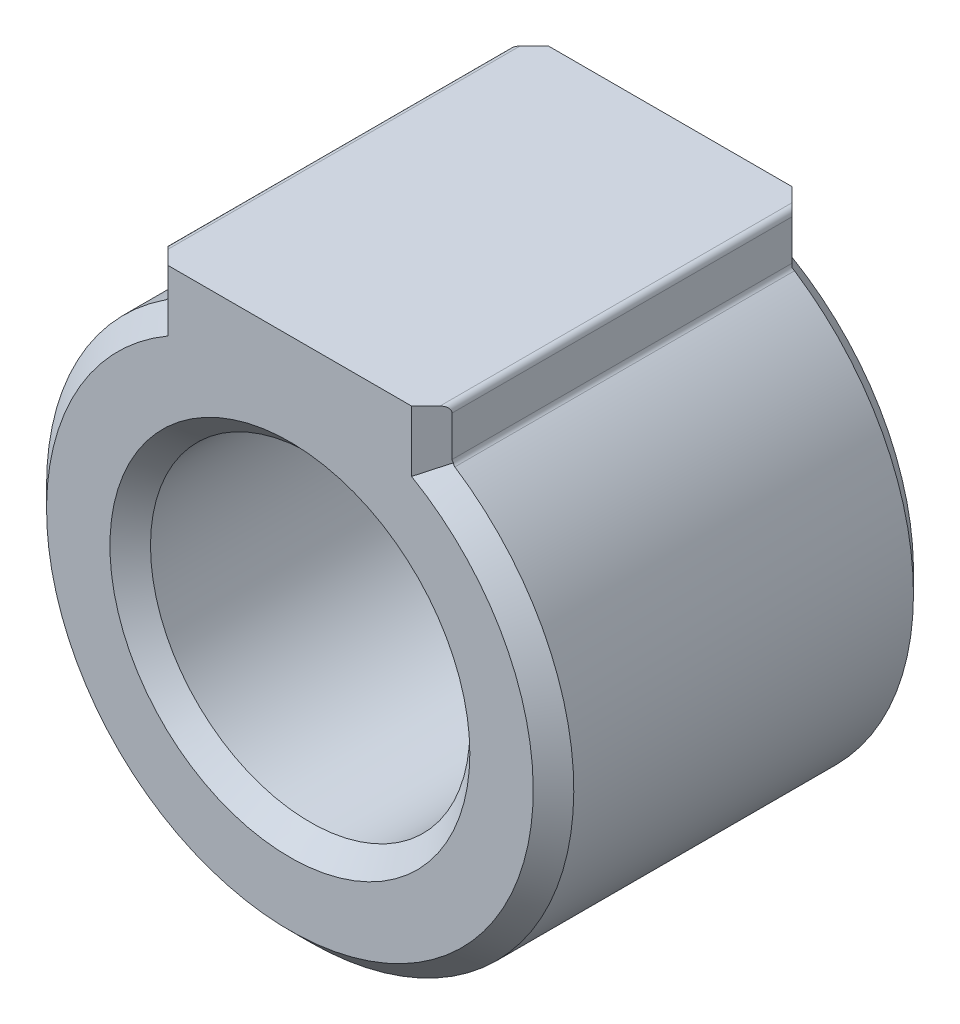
ISO-10303-21;
HEADER;
FILE_DESCRIPTION(('STEP AP214'),'2;1');
FILE_NAME('part.step','',(''),(''),'','','');
FILE_SCHEMA(('AUTOMOTIVE_DESIGN { 1 0 10303 214 1 1 1 1 }'));
ENDSEC;
DATA;
#1=APPLICATION_CONTEXT('core data for automotive mechanical design processes');
#2=APPLICATION_PROTOCOL_DEFINITION('international standard','automotive_design',2000,#1);
#3=PRODUCT_CONTEXT('',#1,'mechanical');
#4=PRODUCT('Part','Part','',(#3));
#5=PRODUCT_RELATED_PRODUCT_CATEGORY('part','',(#4));
#6=PRODUCT_DEFINITION_FORMATION('','',#4);
#7=PRODUCT_DEFINITION_CONTEXT('part definition',#1,'design');
#8=PRODUCT_DEFINITION('design','',#6,#7);
#9=PRODUCT_DEFINITION_SHAPE('','',#8);
#10=(LENGTH_UNIT() NAMED_UNIT(*) SI_UNIT(.MILLI.,.METRE.));
#11=(NAMED_UNIT(*) PLANE_ANGLE_UNIT() SI_UNIT($,.RADIAN.));
#12=(NAMED_UNIT(*) SI_UNIT($,.STERADIAN.) SOLID_ANGLE_UNIT());
#13=UNCERTAINTY_MEASURE_WITH_UNIT(LENGTH_MEASURE(1.E-05),#10,'distance_accuracy_value','');
#14=(GEOMETRIC_REPRESENTATION_CONTEXT(3) GLOBAL_UNCERTAINTY_ASSIGNED_CONTEXT((#13)) GLOBAL_UNIT_ASSIGNED_CONTEXT((#10,
#11,#12)) REPRESENTATION_CONTEXT('',''));
#15=CARTESIAN_POINT('',(0.,0.,0.));
#16=DIRECTION('',(0.,0.,1.));
#17=DIRECTION('',(1.,0.,0.));
#18=AXIS2_PLACEMENT_3D('',#15,#16,#17);
#19=CARTESIAN_POINT('',(0.,0.,0.));
#20=DIRECTION('',(0.,0.,1.));
#21=DIRECTION('',(1.,0.,0.));
#22=AXIS2_PLACEMENT_3D('',#19,#20,#21);
#23=CYLINDRICAL_SURFACE('',#22,2.);
#24=CARTESIAN_POINT('',(0.,0.,0.254000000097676));
#25=DIRECTION('',(0.,0.,-1.));
#26=DIRECTION('',(-1.,0.,0.));
#27=AXIS2_PLACEMENT_3D('',#24,#25,#26);
#28=CIRCLE('',#27,2.00000000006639);
#29=CARTESIAN_POINT('',(-2.00000000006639,0.,0.254000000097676));
#30=VERTEX_POINT('',#29);
#31=EDGE_CURVE('E284',#30,#30,#28,.T.);
#32=ORIENTED_EDGE('',*,*,#31,.T.);
#33=EDGE_LOOP('',(#32));
#34=FACE_BOUND('',#33,.T.);
#35=CARTESIAN_POINT('',(0.,0.,4.50849999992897));
#36=DIRECTION('',(0.,0.,1.));
#37=DIRECTION('',(-1.,0.,0.));
#38=AXIS2_PLACEMENT_3D('',#35,#36,#37);
#39=CIRCLE('',#38,2.00000000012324);
#40=CARTESIAN_POINT('',(-2.00000000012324,0.,4.50849999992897));
#41=VERTEX_POINT('',#40);
#42=EDGE_CURVE('E266',#41,#41,#39,.T.);
#43=ORIENTED_EDGE('',*,*,#42,.T.);
#44=EDGE_LOOP('',(#43));
#45=FACE_BOUND('',#44,.T.);
#46=ADVANCED_FACE('F16',(#34,#45),#23,.F.);
#47=CARTESIAN_POINT('',(-1.7018000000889,3.32740000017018,0.));
#48=DIRECTION('',(0.,0.,1.));
#49=DIRECTION('',(1.,0.,0.));
#50=AXIS2_PLACEMENT_3D('',#47,#48,#49);
#51=CYLINDRICAL_SURFACE('',#50,0.0762);
#52=CARTESIAN_POINT('',(-1.7018000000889,3.32740000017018,0.177800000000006));
#53=DIRECTION('',(-0.707106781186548,0.,-0.707106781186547));
#54=DIRECTION('',(-0.707106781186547,0.,0.707106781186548));
#55=AXIS2_PLACEMENT_3D('',#52,#53,#54);
#56=ELLIPSE('',#55,0.10776307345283,0.0762);
#57=CARTESIAN_POINT('',(-1.7018000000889,3.40360000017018,0.177800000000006));
#58=VERTEX_POINT('',#57);
#59=CARTESIAN_POINT('',(-1.7780000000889,3.32740000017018,0.254000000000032));
#60=VERTEX_POINT('',#59);
#61=EDGE_CURVE('E287',#58,#60,#56,.F.);
#62=ORIENTED_EDGE('',*,*,#61,.T.);
#63=DIRECTION('',(0.,0.,1.));
#64=VECTOR('',#63,1.);
#65=CARTESIAN_POINT('',(-1.7780000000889,3.32740000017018,0.));
#66=LINE('',#65,#64);
#67=CARTESIAN_POINT('',(-1.7780000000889,3.32740000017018,4.50849999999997));
#68=VERTEX_POINT('',#67);
#69=EDGE_CURVE('E263',#68,#60,#66,.F.);
#70=ORIENTED_EDGE('',*,*,#69,.F.);
#71=CARTESIAN_POINT('',(-1.7018000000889,3.32740000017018,4.5847));
#72=DIRECTION('',(-0.707106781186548,0.,0.707106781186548));
#73=DIRECTION('',(0.707106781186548,0.,0.707106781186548));
#74=AXIS2_PLACEMENT_3D('',#71,#72,#73);
#75=ELLIPSE('',#74,0.10776307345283,0.0762);
#76=CARTESIAN_POINT('',(-1.7018000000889,3.40360000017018,4.5847));
#77=VERTEX_POINT('',#76);
#78=EDGE_CURVE('E19',#68,#77,#75,.F.);
#79=ORIENTED_EDGE('',*,*,#78,.T.);
#80=DIRECTION('',(0.,0.,1.));
#81=VECTOR('',#80,1.);
#82=CARTESIAN_POINT('',(-1.7018000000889,3.40360000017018,0.));
#83=LINE('',#82,#81);
#84=EDGE_CURVE('E274',#58,#77,#83,.T.);
#85=ORIENTED_EDGE('',*,*,#84,.F.);
#86=EDGE_LOOP('',(#62,#70,#79,#85));
#87=FACE_BOUND('',#86,.T.);
#88=ADVANCED_FACE('F332',(#87),#51,.T.);
#89=CARTESIAN_POINT('',(0.,0.,-1.70530256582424E-10));
#90=DIRECTION('',(0.,0.,-1.));
#91=DIRECTION('',(-1.,0.,0.));
#92=AXIS2_PLACEMENT_3D('',#89,#90,#91);
#93=CONICAL_SURFACE('',#92,2.2539999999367,0.785398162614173);
#94=CARTESIAN_POINT('',(0.,0.,-1.13686837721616E-10));
#95=DIRECTION('',(0.,0.,-1.));
#96=DIRECTION('',(-1.,0.,0.));
#97=AXIS2_PLACEMENT_3D('',#94,#95,#96);
#98=CIRCLE('',#97,2.25399999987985);
#99=CARTESIAN_POINT('',(-2.25399999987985,0.,-1.13686837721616E-10));
#100=VERTEX_POINT('',#99);
#101=EDGE_CURVE('E279',#100,#100,#98,.T.);
#102=ORIENTED_EDGE('',*,*,#101,.T.);
#103=EDGE_LOOP('',(#102));
#104=FACE_BOUND('',#103,.T.);
#105=ORIENTED_EDGE('',*,*,#31,.F.);
#106=EDGE_LOOP('',(#105));
#107=FACE_BOUND('',#106,.T.);
#108=ADVANCED_FACE('F436',(#104,#107),#93,.F.);
#109=CARTESIAN_POINT('',(1.7018000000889,3.32740000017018,0.));
#110=DIRECTION('',(0.,0.,1.));
#111=DIRECTION('',(1.,0.,0.));
#112=AXIS2_PLACEMENT_3D('',#109,#110,#111);
#113=CYLINDRICAL_SURFACE('',#112,0.0762);
#114=CARTESIAN_POINT('',(1.7018000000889,3.32740000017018,0.177800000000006));
#115=DIRECTION('',(0.707106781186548,0.,-0.707106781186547));
#116=DIRECTION('',(0.707106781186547,0.,0.707106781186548));
#117=AXIS2_PLACEMENT_3D('',#114,#115,#116);
#118=ELLIPSE('',#117,0.10776307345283,0.0762);
#119=CARTESIAN_POINT('',(1.7780000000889,3.32740000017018,0.253999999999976));
#120=VERTEX_POINT('',#119);
#121=CARTESIAN_POINT('',(1.7018000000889,3.40360000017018,0.177800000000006));
#122=VERTEX_POINT('',#121);
#123=EDGE_CURVE('E283',#120,#122,#118,.F.);
#124=ORIENTED_EDGE('',*,*,#123,.T.);
#125=DIRECTION('',(0.,0.,1.));
#126=VECTOR('',#125,1.);
#127=CARTESIAN_POINT('',(1.7018000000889,3.40360000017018,0.));
#128=LINE('',#127,#126);
#129=CARTESIAN_POINT('',(1.7018000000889,3.40360000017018,4.5847));
#130=VERTEX_POINT('',#129);
#131=EDGE_CURVE('E147',#130,#122,#128,.F.);
#132=ORIENTED_EDGE('',*,*,#131,.F.);
#133=CARTESIAN_POINT('',(1.7018000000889,3.32740000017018,4.5847));
#134=DIRECTION('',(0.707106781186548,0.,0.707106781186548));
#135=DIRECTION('',(-0.707106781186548,0.,0.707106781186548));
#136=AXIS2_PLACEMENT_3D('',#133,#134,#135);
#137=ELLIPSE('',#136,0.10776307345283,0.0762);
#138=CARTESIAN_POINT('',(1.7780000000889,3.32740000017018,4.50849999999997));
#139=VERTEX_POINT('',#138);
#140=EDGE_CURVE('E143',#130,#139,#137,.F.);
#141=ORIENTED_EDGE('',*,*,#140,.T.);
#142=DIRECTION('',(0.,0.,-1.));
#143=VECTOR('',#142,1.);
#144=CARTESIAN_POINT('',(1.7780000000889,3.32740000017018,0.));
#145=LINE('',#144,#143);
#146=EDGE_CURVE('E251',#120,#139,#145,.F.);
#147=ORIENTED_EDGE('',*,*,#146,.F.);
#148=EDGE_LOOP('',(#124,#132,#141,#147));
#149=FACE_BOUND('',#148,.T.);
#150=ADVANCED_FACE('F361',(#149),#113,.T.);
#151=CARTESIAN_POINT('',(-1.7780000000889,3.40360000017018,0.));
#152=DIRECTION('',(0.,1.,0.));
#153=DIRECTION('',(0.,0.,1.));
#154=AXIS2_PLACEMENT_3D('',#151,#152,#153);
#155=PLANE('',#154);
#156=DIRECTION('',(1.,0.,0.));
#157=VECTOR('',#156,1.);
#158=CARTESIAN_POINT('',(0.,3.40360000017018,0.));
#159=LINE('',#158,#157);
#160=CARTESIAN_POINT('',(1.5240000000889,3.40360000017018,0.));
#161=VERTEX_POINT('',#160);
#162=CARTESIAN_POINT('',(-1.5240000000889,3.40360000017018,0.));
#163=VERTEX_POINT('',#162);
#164=EDGE_CURVE('E126',#161,#163,#159,.F.);
#165=ORIENTED_EDGE('',*,*,#164,.T.);
#166=DIRECTION('',(-0.707106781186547,0.,0.707106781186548));
#167=VECTOR('',#166,1.);
#168=CARTESIAN_POINT('',(-1.6510000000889,3.40360000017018,0.126999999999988));
#169=LINE('',#168,#167);
#170=EDGE_CURVE('E328',#58,#163,#169,.F.);
#171=ORIENTED_EDGE('',*,*,#170,.F.);
#172=ORIENTED_EDGE('',*,*,#84,.T.);
#173=DIRECTION('',(0.707106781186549,0.,0.707106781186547));
#174=VECTOR('',#173,1.);
#175=CARTESIAN_POINT('',(-1.7018000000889,3.40360000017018,4.5847));
#176=LINE('',#175,#174);
#177=CARTESIAN_POINT('',(-1.5240000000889,3.40360000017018,4.7625));
#178=VERTEX_POINT('',#177);
#179=EDGE_CURVE('E148',#77,#178,#176,.T.);
#180=ORIENTED_EDGE('',*,*,#179,.T.);
#181=DIRECTION('',(1.,0.,0.));
#182=VECTOR('',#181,1.);
#183=CARTESIAN_POINT('',(0.,3.40360000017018,4.7625));
#184=LINE('',#183,#182);
#185=CARTESIAN_POINT('',(1.5240000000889,3.40360000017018,4.7625));
#186=VERTEX_POINT('',#185);
#187=EDGE_CURVE('E151',#186,#178,#184,.F.);
#188=ORIENTED_EDGE('',*,*,#187,.F.);
#189=DIRECTION('',(0.70710678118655,0.,-0.707106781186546));
#190=VECTOR('',#189,1.);
#191=CARTESIAN_POINT('',(1.5240000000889,3.40360000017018,4.7625));
#192=LINE('',#191,#190);
#193=EDGE_CURVE('E134',#186,#130,#192,.T.);
#194=ORIENTED_EDGE('',*,*,#193,.T.);
#195=ORIENTED_EDGE('',*,*,#131,.T.);
#196=DIRECTION('',(-0.707106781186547,0.,-0.707106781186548));
#197=VECTOR('',#196,1.);
#198=CARTESIAN_POINT('',(1.6510000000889,3.40360000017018,0.126999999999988));
#199=LINE('',#198,#197);
#200=EDGE_CURVE('E158',#161,#122,#199,.F.);
#201=ORIENTED_EDGE('',*,*,#200,.F.);
#202=EDGE_LOOP('',(#165,#171,#172,#180,#188,#194,#195,#201));
#203=FACE_BOUND('',#202,.T.);
#204=ADVANCED_FACE('F152',(#203),#155,.T.);
#205=CARTESIAN_POINT('',(0.,0.,4.76250000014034));
#206=DIRECTION('',(0.,0.,1.));
#207=DIRECTION('',(1.,0.,0.));
#208=AXIS2_PLACEMENT_3D('',#205,#206,#207);
#209=CONICAL_SURFACE('',#208,2.25399999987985,0.785398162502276);
#210=CARTESIAN_POINT('',(0.,0.,4.76250000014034));
#211=DIRECTION('',(0.,0.,1.));
#212=DIRECTION('',(1.,0.,0.));
#213=AXIS2_PLACEMENT_3D('',#210,#211,#212);
#214=CIRCLE('',#213,2.25399999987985);
#215=CARTESIAN_POINT('',(2.25399999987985,0.,4.76250000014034));
#216=VERTEX_POINT('',#215);
#217=EDGE_CURVE('E157',#216,#216,#214,.F.);
#218=ORIENTED_EDGE('',*,*,#217,.F.);
#219=EDGE_LOOP('',(#218));
#220=FACE_BOUND('',#219,.T.);
#221=ORIENTED_EDGE('',*,*,#42,.F.);
#222=EDGE_LOOP('',(#221));
#223=FACE_BOUND('',#222,.T.);
#224=ADVANCED_FACE('F424',(#220,#223),#209,.F.);
#225=CARTESIAN_POINT('',(-1.7780000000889,2.78243059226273,0.));
#226=DIRECTION('',(-1.,0.,0.));
#227=DIRECTION('',(0.,0.,1.));
#228=AXIS2_PLACEMENT_3D('',#225,#226,#227);
#229=PLANE('',#228);
#230=DIRECTION('',(0.,0.,1.));
#231=VECTOR('',#230,1.);
#232=CARTESIAN_POINT('',(-1.7780000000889,2.82385863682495,0.));
#233=LINE('',#232,#231);
#234=CARTESIAN_POINT('',(-1.7780000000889,2.82385863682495,0.254000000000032));
#235=VERTEX_POINT('',#234);
#236=CARTESIAN_POINT('',(-1.7780000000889,2.82385863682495,4.50849999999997));
#237=VERTEX_POINT('',#236);
#238=EDGE_CURVE('E321',#235,#237,#233,.T.);
#239=ORIENTED_EDGE('',*,*,#238,.T.);
#240=DIRECTION('',(0.,1.,0.));
#241=VECTOR('',#240,1.);
#242=CARTESIAN_POINT('',(-1.7780000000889,1.61622361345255,4.50850000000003));
#243=LINE('',#242,#241);
#244=EDGE_CURVE('E167',#68,#237,#243,.F.);
#245=ORIENTED_EDGE('',*,*,#244,.F.);
#246=ORIENTED_EDGE('',*,*,#69,.T.);
#247=DIRECTION('',(0.,1.,0.));
#248=VECTOR('',#247,1.);
#249=CARTESIAN_POINT('',(-1.7780000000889,1.61622361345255,0.253999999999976));
#250=LINE('',#249,#248);
#251=EDGE_CURVE('E259',#235,#60,#250,.T.);
#252=ORIENTED_EDGE('',*,*,#251,.F.);
#253=EDGE_LOOP('',(#239,#245,#246,#252));
#254=FACE_BOUND('',#253,.T.);
#255=ADVANCED_FACE('F416',(#254),#229,.T.);
#256=CARTESIAN_POINT('',(0.,0.450016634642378,0.));
#257=DIRECTION('',(0.,0.,1.));
#258=DIRECTION('',(1.,0.,0.));
#259=AXIS2_PLACEMENT_3D('',#256,#257,#258);
#260=PLANE('',#259);
#261=ORIENTED_EDGE('',*,*,#101,.F.);
#262=EDGE_LOOP('',(#261));
#263=FACE_BOUND('',#262,.T.);
#264=ORIENTED_EDGE('',*,*,#164,.F.);
#265=DIRECTION('',(0.,1.,0.));
#266=VECTOR('',#265,1.);
#267=CARTESIAN_POINT('',(1.5240000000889,1.92680831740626,0.));
#268=LINE('',#267,#266);
#269=CARTESIAN_POINT('',(1.52400000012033,2.63964543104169,-3.71924713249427E-11));
#270=VERTEX_POINT('',#269);
#271=EDGE_CURVE('E349',#270,#161,#268,.T.);
#272=ORIENTED_EDGE('',*,*,#271,.F.);
#273=CARTESIAN_POINT('',(0.,0.,-5.6843418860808E-11));
#274=DIRECTION('',(0.,0.,1.));
#275=DIRECTION('',(1.,0.,0.));
#276=AXIS2_PLACEMENT_3D('',#273,#274,#275);
#277=CIRCLE('',#276,3.04800000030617);
#278=CARTESIAN_POINT('',(-1.52400000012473,2.63964543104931,-2.8421709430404E-11));
#279=VERTEX_POINT('',#278);
#280=EDGE_CURVE('E250',#279,#270,#277,.T.);
#281=ORIENTED_EDGE('',*,*,#280,.F.);
#282=DIRECTION('',(0.,1.,0.));
#283=VECTOR('',#282,1.);
#284=CARTESIAN_POINT('',(-1.5240000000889,1.61622361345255,0.));
#285=LINE('',#284,#283);
#286=EDGE_CURVE('E340',#163,#279,#285,.F.);
#287=ORIENTED_EDGE('',*,*,#286,.F.);
#288=EDGE_LOOP('',(#264,#272,#281,#287));
#289=FACE_BOUND('',#288,.T.);
#290=ADVANCED_FACE('F414',(#263,#289),#260,.F.);
#291=CARTESIAN_POINT('',(-1.6510000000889,1.61622361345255,0.126999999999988));
#292=DIRECTION('',(-0.707106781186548,0.,-0.707106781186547));
#293=DIRECTION('',(-0.707106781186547,0.,0.707106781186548));
#294=AXIS2_PLACEMENT_3D('',#291,#292,#293);
#295=PLANE('',#294);
#296=CARTESIAN_POINT('',(-1.8542000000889,2.82385863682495,0.330200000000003));
#297=DIRECTION('',(-0.707106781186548,0.,-0.707106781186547));
#298=DIRECTION('',(-0.707106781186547,0.,0.707106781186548));
#299=AXIS2_PLACEMENT_3D('',#296,#297,#298);
#300=ELLIPSE('',#299,0.10776307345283,0.0762);
#301=CARTESIAN_POINT('',(-1.78724056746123,2.78748725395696,0.263240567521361));
#302=VERTEX_POINT('',#301);
#303=EDGE_CURVE('E165',#302,#235,#300,.F.);
#304=ORIENTED_EDGE('',*,*,#303,.T.);
#305=ORIENTED_EDGE('',*,*,#251,.T.);
#306=ORIENTED_EDGE('',*,*,#61,.F.);
#307=ORIENTED_EDGE('',*,*,#170,.T.);
#308=ORIENTED_EDGE('',*,*,#286,.T.);
#309=CARTESIAN_POINT('',(-1.77800000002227,2.78243059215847,0.254000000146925));
#310=CARTESIAN_POINT('',(-1.76706834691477,2.7764432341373,0.243068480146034));
#311=CARTESIAN_POINT('',(-1.75614127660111,2.77043909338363,0.232141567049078));
#312=CARTESIAN_POINT('',(-1.73438536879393,2.75844561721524,0.210385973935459));
#313=CARTESIAN_POINT('',(-1.72355645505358,2.75245655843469,0.199557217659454));
#314=CARTESIAN_POINT('',(-1.70199690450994,2.74049351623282,0.177997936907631));
#315=CARTESIAN_POINT('',(-1.69126619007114,2.73451981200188,0.167267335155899));
#316=CARTESIAN_POINT('',(-1.6699030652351,2.72258776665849,0.145904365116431));
#317=CARTESIAN_POINT('',(-1.65927057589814,2.71662970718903,0.135271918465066));
#318=CARTESIAN_POINT('',(-1.63810391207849,2.70472925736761,0.11410525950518));
#319=CARTESIAN_POINT('',(-1.62756965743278,2.6987871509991,0.103570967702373));
#320=CARTESIAN_POINT('',(-1.60659945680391,2.68691893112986,0.0826006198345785));
#321=CARTESIAN_POINT('',(-1.59616342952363,2.68099310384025,0.0721644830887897));
#322=CARTESIAN_POINT('',(-1.57538966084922,2.66915778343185,0.0513904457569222));
#323=CARTESIAN_POINT('',(-1.56505183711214,2.66324857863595,0.0410524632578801));
#324=CARTESIAN_POINT('',(-1.54447443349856,2.65144686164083,0.0204747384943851));
#325=CARTESIAN_POINT('',(-1.5342347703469,2.64555463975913,0.0102349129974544));
#326=CARTESIAN_POINT('',(-1.52400000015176,2.63964543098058,-7.44335149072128E-11));
#327=B_SPLINE_CURVE_WITH_KNOTS('',3,(#309,#310,#311,#312,#313,#314,#315,#316,#317,#318,#319,
#320,#321,#322,#323,#324,#325,#326),.UNSPECIFIED.,.F.,.F.,(4,2,2,2,2,2,2,2,4),(0.,
0.0497355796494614,0.0990667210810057,0.147993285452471,0.196515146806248,0.244632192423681,
0.292344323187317,0.339651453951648,0.386553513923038),.UNSPECIFIED.);
#328=CARTESIAN_POINT('',(-1.77800000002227,2.78243059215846,0.254000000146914));
#329=VERTEX_POINT('',#328);
#330=EDGE_CURVE('E229',#329,#279,#327,.T.);
#331=ORIENTED_EDGE('',*,*,#330,.F.);
#332=CARTESIAN_POINT('',(-1.78724058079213,2.78748727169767,0.26324058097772));
#333=CARTESIAN_POINT('',(-1.78685515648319,2.78727703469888,0.262855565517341));
#334=CARTESIAN_POINT('',(-1.78646977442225,2.78706673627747,0.262470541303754));
#335=CARTESIAN_POINT('',(-1.78569911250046,2.786646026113,0.261700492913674));
#336=CARTESIAN_POINT('',(-1.78531383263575,2.78643561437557,0.261315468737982));
#337=CARTESIAN_POINT('',(-1.78454337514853,2.78601467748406,0.260545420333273));
#338=CARTESIAN_POINT('',(-1.78415819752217,2.78580415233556,0.260160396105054));
#339=CARTESIAN_POINT('',(-1.78338794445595,2.78538298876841,0.259390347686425));
#340=CARTESIAN_POINT('',(-1.78300286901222,2.78517235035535,0.25900532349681));
#341=CARTESIAN_POINT('',(-1.78223282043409,2.78475096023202,0.258235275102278));
#342=CARTESIAN_POINT('',(-1.78184784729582,2.78454020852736,0.257850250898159));
#343=CARTESIAN_POINT('',(-1.7810780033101,2.78411859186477,0.257080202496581));
#344=CARTESIAN_POINT('',(-1.7806931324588,2.78390772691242,0.256695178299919));
#345=CARTESIAN_POINT('',(-1.77992349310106,2.78348588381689,0.255925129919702));
#346=CARTESIAN_POINT('',(-1.77953872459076,2.7832749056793,0.255540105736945));
#347=CARTESIAN_POINT('',(-1.77876928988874,2.78285283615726,0.254770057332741));
#348=CARTESIAN_POINT('',(-1.77838462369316,2.78264174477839,0.254385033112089));
#349=CARTESIAN_POINT('',(-1.77799999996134,2.78243059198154,0.254000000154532));
#350=B_SPLINE_CURVE_WITH_KNOTS('',3,(#332,#333,#334,#335,#336,#337,#338,#339,#340,#341,#342,
#343,#344,#345,#346,#347,#348,#349),.UNSPECIFIED.,.F.,.F.,(4,2,2,2,2,2,2,2,4),(0.,
0.00175182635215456,0.00350357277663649,0.00525523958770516,0.00700682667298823,
0.00875833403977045,0.010509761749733,0.012261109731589,0.0140123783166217),.UNSPECIFIED.);
#351=EDGE_CURVE('E224',#302,#329,#350,.T.);
#352=ORIENTED_EDGE('',*,*,#351,.F.);
#353=EDGE_LOOP('',(#304,#305,#306,#307,#308,#331,#352));
#354=FACE_BOUND('',#353,.T.);
#355=ADVANCED_FACE('F413',(#354),#295,.T.);
#356=CARTESIAN_POINT('',(1.7780000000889,3.40360000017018,0.));
#357=DIRECTION('',(1.,0.,0.));
#358=DIRECTION('',(0.,0.,-1.));
#359=AXIS2_PLACEMENT_3D('',#356,#357,#358);
#360=PLANE('',#359);
#361=DIRECTION('',(0.,0.,1.));
#362=VECTOR('',#361,1.);
#363=CARTESIAN_POINT('',(1.7780000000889,2.82385863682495,0.));
#364=LINE('',#363,#362);
#365=CARTESIAN_POINT('',(1.7780000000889,2.82385863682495,4.50850000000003));
#366=VERTEX_POINT('',#365);
#367=CARTESIAN_POINT('',(1.7780000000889,2.82385863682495,0.253999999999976));
#368=VERTEX_POINT('',#367);
#369=EDGE_CURVE('E197',#366,#368,#364,.F.);
#370=ORIENTED_EDGE('',*,*,#369,.T.);
#371=DIRECTION('',(0.,1.,0.));
#372=VECTOR('',#371,1.);
#373=CARTESIAN_POINT('',(1.7780000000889,1.92680831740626,0.253999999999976));
#374=LINE('',#373,#372);
#375=EDGE_CURVE('E258',#120,#368,#374,.F.);
#376=ORIENTED_EDGE('',*,*,#375,.F.);
#377=ORIENTED_EDGE('',*,*,#146,.T.);
#378=DIRECTION('',(0.,1.,0.));
#379=VECTOR('',#378,1.);
#380=CARTESIAN_POINT('',(1.7780000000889,1.92680831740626,4.50850000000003));
#381=LINE('',#380,#379);
#382=EDGE_CURVE('E162',#366,#139,#381,.T.);
#383=ORIENTED_EDGE('',*,*,#382,.F.);
#384=EDGE_LOOP('',(#370,#376,#377,#383));
#385=FACE_BOUND('',#384,.T.);
#386=ADVANCED_FACE('F364',(#385),#360,.T.);
#387=CARTESIAN_POINT('',(1.6510000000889,1.92680831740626,0.126999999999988));
#388=DIRECTION('',(0.707106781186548,0.,-0.707106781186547));
#389=DIRECTION('',(-0.707106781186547,0.,-0.707106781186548));
#390=AXIS2_PLACEMENT_3D('',#387,#388,#389);
#391=PLANE('',#390);
#392=ORIENTED_EDGE('',*,*,#271,.T.);
#393=ORIENTED_EDGE('',*,*,#200,.T.);
#394=ORIENTED_EDGE('',*,*,#123,.F.);
#395=ORIENTED_EDGE('',*,*,#375,.T.);
#396=CARTESIAN_POINT('',(1.8542000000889,2.82385863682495,0.330200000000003));
#397=DIRECTION('',(0.707106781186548,0.,-0.707106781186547));
#398=DIRECTION('',(0.707106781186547,0.,0.707106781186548));
#399=AXIS2_PLACEMENT_3D('',#396,#397,#398);
#400=ELLIPSE('',#399,0.10776307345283,0.0762);
#401=CARTESIAN_POINT('',(1.78724043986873,2.78748720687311,0.26324044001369));
#402=VERTEX_POINT('',#401);
#403=EDGE_CURVE('E199',#368,#402,#400,.F.);
#404=ORIENTED_EDGE('',*,*,#403,.T.);
#405=CARTESIAN_POINT('',(1.77799999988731,2.78243059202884,0.254000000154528));
#406=CARTESIAN_POINT('',(1.77838462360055,2.78264174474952,0.254385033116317));
#407=CARTESIAN_POINT('',(1.77876928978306,2.78285283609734,0.254770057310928));
#408=CARTESIAN_POINT('',(1.77953872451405,2.78327490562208,0.255540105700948));
#409=CARTESIAN_POINT('',(1.7799234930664,2.78348588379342,0.255925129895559));
#410=CARTESIAN_POINT('',(1.78069313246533,2.78390772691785,0.256695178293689));
#411=CARTESIAN_POINT('',(1.78107800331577,2.78411859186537,0.257080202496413));
#412=CARTESIAN_POINT('',(1.78184784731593,2.78454020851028,0.25785025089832));
#413=CARTESIAN_POINT('',(1.78223282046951,2.78475096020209,0.258235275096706));
#414=CARTESIAN_POINT('',(1.78300286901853,2.78517235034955,0.259005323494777));
#415=CARTESIAN_POINT('',(1.78338794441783,2.78538298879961,0.259390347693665));
#416=CARTESIAN_POINT('',(1.78415819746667,2.7858041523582,0.260160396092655));
#417=CARTESIAN_POINT('',(1.78454337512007,2.78601467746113,0.26054542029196));
#418=CARTESIAN_POINT('',(1.78531383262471,2.78643561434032,0.261315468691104));
#419=CARTESIAN_POINT('',(1.78569911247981,2.78664602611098,0.261700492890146));
#420=CARTESIAN_POINT('',(1.78646977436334,2.78706673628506,0.262470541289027));
#421=CARTESIAN_POINT('',(1.78685515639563,2.78727703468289,0.262855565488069));
#422=CARTESIAN_POINT('',(1.78724058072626,2.78748727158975,0.263240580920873));
#423=B_SPLINE_CURVE_WITH_KNOTS('',3,(#405,#406,#407,#408,#409,#410,#411,#412,#413,#414,#415,
#416,#417,#418,#419,#420,#421,#422),.UNSPECIFIED.,.F.,.F.,(4,2,2,2,2,2,2,2,4),(0.,
0.00175126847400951,0.00350261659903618,0.00525404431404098,0.00700555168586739,
0.00875713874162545,0.010508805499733,0.0122605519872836,0.0140123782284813),.UNSPECIFIED.);
#424=CARTESIAN_POINT('',(1.77800000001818,2.78243059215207,0.25400000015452));
#425=VERTEX_POINT('',#424);
#426=EDGE_CURVE('E219',#425,#402,#423,.T.);
#427=ORIENTED_EDGE('',*,*,#426,.F.);
#428=CARTESIAN_POINT('',(1.52400000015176,2.63964543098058,-7.44335149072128E-11));
#429=CARTESIAN_POINT('',(1.53423477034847,2.645554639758,0.0102349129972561));
#430=CARTESIAN_POINT('',(1.54447443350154,2.65144686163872,0.0204747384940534));
#431=CARTESIAN_POINT('',(1.56505183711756,2.66324857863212,0.0410524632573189));
#432=CARTESIAN_POINT('',(1.57538966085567,2.66915778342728,0.0513904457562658));
#433=CARTESIAN_POINT('',(1.59616342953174,2.68099310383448,0.0721644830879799));
#434=CARTESIAN_POINT('',(1.60659945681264,2.68691893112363,0.0826006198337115));
#435=CARTESIAN_POINT('',(1.62756965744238,2.69878715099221,0.103570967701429));
#436=CARTESIAN_POINT('',(1.63810391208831,2.70472925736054,0.114105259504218));
#437=CARTESIAN_POINT('',(1.659270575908,2.71662970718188,0.135271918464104));
#438=CARTESIAN_POINT('',(1.66990306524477,2.72258776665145,0.145904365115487));
#439=CARTESIAN_POINT('',(1.69126619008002,2.73451981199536,0.167267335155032));
#440=CARTESIAN_POINT('',(1.70199690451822,2.74049351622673,0.177997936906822));
#441=CARTESIAN_POINT('',(1.72355645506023,2.75245655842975,0.199557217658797));
#442=CARTESIAN_POINT('',(1.73438536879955,2.75844561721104,0.210385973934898));
#443=CARTESIAN_POINT('',(1.75614127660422,2.77043909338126,0.232141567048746));
#444=CARTESIAN_POINT('',(1.76706834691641,2.77644323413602,0.243068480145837));
#445=CARTESIAN_POINT('',(1.77800000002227,2.78243059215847,0.254000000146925));
#446=B_SPLINE_CURVE_WITH_KNOTS('',3,(#428,#429,#430,#431,#432,#433,#434,#435,#436,#437,#438,
#439,#440,#441,#442,#443,#444,#445),.UNSPECIFIED.,.F.,.F.,(4,2,2,2,2,2,2,2,4),(0.,
0.0469020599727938,0.0942091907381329,0.141921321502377,0.190038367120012,0.238560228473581,
0.287486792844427,0.336817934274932,0.386553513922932),.UNSPECIFIED.);
#447=EDGE_CURVE('E241',#270,#425,#446,.T.);
#448=ORIENTED_EDGE('',*,*,#447,.F.);
#449=EDGE_LOOP('',(#392,#393,#394,#395,#404,#427,#448));
#450=FACE_BOUND('',#449,.T.);
#451=ADVANCED_FACE('F357',(#450),#391,.T.);
#452=CARTESIAN_POINT('',(0.,0.450016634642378,4.7625));
#453=DIRECTION('',(0.,0.,1.));
#454=DIRECTION('',(1.,0.,0.));
#455=AXIS2_PLACEMENT_3D('',#452,#453,#454);
#456=PLANE('',#455);
#457=ORIENTED_EDGE('',*,*,#217,.T.);
#458=EDGE_LOOP('',(#457));
#459=FACE_BOUND('',#458,.T.);
#460=DIRECTION('',(0.,1.,0.));
#461=VECTOR('',#460,1.);
#462=CARTESIAN_POINT('',(-1.5240000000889,1.61622361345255,4.7625));
#463=LINE('',#462,#461);
#464=CARTESIAN_POINT('',(-1.52400000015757,2.63964543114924,4.7625));
#465=VERTEX_POINT('',#464);
#466=EDGE_CURVE('E163',#465,#178,#463,.T.);
#467=ORIENTED_EDGE('',*,*,#466,.F.);
#468=CARTESIAN_POINT('',(0.,0.,4.76250000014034));
#469=DIRECTION('',(0.,0.,-1.));
#470=DIRECTION('',(-1.,0.,0.));
#471=AXIS2_PLACEMENT_3D('',#468,#469,#470);
#472=CIRCLE('',#471,3.04800000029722);
#473=CARTESIAN_POINT('',(1.52400000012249,2.63964543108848,4.76250000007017));
#474=VERTEX_POINT('',#473);
#475=EDGE_CURVE('E161',#474,#465,#472,.T.);
#476=ORIENTED_EDGE('',*,*,#475,.F.);
#477=DIRECTION('',(0.,1.,0.));
#478=VECTOR('',#477,1.);
#479=CARTESIAN_POINT('',(1.5240000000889,1.92680831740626,4.7625));
#480=LINE('',#479,#478);
#481=EDGE_CURVE('E140',#186,#474,#480,.F.);
#482=ORIENTED_EDGE('',*,*,#481,.F.);
#483=ORIENTED_EDGE('',*,*,#187,.T.);
#484=EDGE_LOOP('',(#467,#476,#482,#483));
#485=FACE_BOUND('',#484,.T.);
#486=ADVANCED_FACE('F160',(#459,#485),#456,.T.);
#487=CARTESIAN_POINT('',(-1.6510000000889,1.61622361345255,4.63550000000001));
#488=DIRECTION('',(-0.707106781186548,0.,0.707106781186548));
#489=DIRECTION('',(0.707106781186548,0.,0.707106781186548));
#490=AXIS2_PLACEMENT_3D('',#487,#488,#489);
#491=PLANE('',#490);
#492=ORIENTED_EDGE('',*,*,#466,.T.);
#493=ORIENTED_EDGE('',*,*,#179,.F.);
#494=ORIENTED_EDGE('',*,*,#78,.F.);
#495=ORIENTED_EDGE('',*,*,#244,.T.);
#496=CARTESIAN_POINT('',(-1.8542000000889,2.82385863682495,4.4323));
#497=DIRECTION('',(-0.707106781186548,0.,0.707106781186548));
#498=DIRECTION('',(0.707106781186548,0.,0.707106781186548));
#499=AXIS2_PLACEMENT_3D('',#496,#497,#498);
#500=ELLIPSE('',#499,0.10776307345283,0.0762);
#501=CARTESIAN_POINT('',(-1.78724058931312,2.78748725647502,4.49925943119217));
#502=VERTEX_POINT('',#501);
#503=EDGE_CURVE('E319',#237,#502,#500,.F.);
#504=ORIENTED_EDGE('',*,*,#503,.T.);
#505=CARTESIAN_POINT('',(-1.77799999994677,2.78243059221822,4.5084999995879));
#506=CARTESIAN_POINT('',(-1.77838462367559,2.78264174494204,4.50811496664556));
#507=CARTESIAN_POINT('',(-1.77876928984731,2.78285283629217,4.50772994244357));
#508=CARTESIAN_POINT('',(-1.77953872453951,2.78327490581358,4.50695989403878));
#509=CARTESIAN_POINT('',(-1.77992349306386,2.78348588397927,4.50657486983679));
#510=CARTESIAN_POINT('',(-1.78069313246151,2.7839077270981,4.50580482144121));
#511=CARTESIAN_POINT('',(-1.78107800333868,2.78411859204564,4.50541979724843));
#512=CARTESIAN_POINT('',(-1.78184784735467,2.78454020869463,4.50464974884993));
#513=CARTESIAN_POINT('',(-1.78223282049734,2.7847509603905,4.504264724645));
#514=CARTESIAN_POINT('',(-1.78300286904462,2.78517235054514,4.50349467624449));
#515=CARTESIAN_POINT('',(-1.78338794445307,2.78538298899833,4.5031096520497));
#516=CARTESIAN_POINT('',(-1.78415819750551,2.78580415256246,4.50233960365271));
#517=CARTESIAN_POINT('',(-1.78454337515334,2.78601467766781,4.50195457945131));
#518=CARTESIAN_POINT('',(-1.78531383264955,2.78643561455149,4.50118453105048));
#519=CARTESIAN_POINT('',(-1.78569911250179,2.78664602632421,4.50079950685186));
#520=CARTESIAN_POINT('',(-1.78646977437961,2.78706673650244,4.50002945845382));
#521=CARTESIAN_POINT('',(-1.78685515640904,2.78727703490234,4.4996444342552));
#522=CARTESIAN_POINT('',(-1.78724058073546,2.78748727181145,4.49925941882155));
#523=B_SPLINE_CURVE_WITH_KNOTS('',3,(#505,#506,#507,#508,#509,#510,#511,#512,#513,#514,#515,
#516,#517,#518,#519,#520,#521,#522),.UNSPECIFIED.,.F.,.F.,(4,2,2,2,2,2,2,2,4),(0.,
0.00175126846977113,0.00350261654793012,0.00525404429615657,0.00700555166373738,
0.00875713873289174,0.0105088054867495,0.0122605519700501,0.0140123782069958),.UNSPECIFIED.);
#524=CARTESIAN_POINT('',(-1.77800000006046,2.78243059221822,4.50849999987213));
#525=VERTEX_POINT('',#524);
#526=EDGE_CURVE('E300',#525,#502,#523,.T.);
#527=ORIENTED_EDGE('',*,*,#526,.F.);
#528=CARTESIAN_POINT('',(-1.5240000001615,2.63964543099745,4.7625000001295));
#529=CARTESIAN_POINT('',(-1.53423477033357,2.64555463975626,4.7522650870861));
#530=CARTESIAN_POINT('',(-1.54447443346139,2.65144686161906,4.74202526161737));
#531=CARTESIAN_POINT('',(-1.565051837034,2.66324857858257,4.72144753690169));
#532=CARTESIAN_POINT('',(-1.57538966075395,2.66915778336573,4.71110955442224));
#533=CARTESIAN_POINT('',(-1.59616342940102,2.68099310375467,4.69033551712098));
#534=CARTESIAN_POINT('',(-1.60659945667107,2.68691893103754,4.67989938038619));
#535=CARTESIAN_POINT('',(-1.6275696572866,2.69878715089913,4.65892903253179));
#536=CARTESIAN_POINT('',(-1.63810391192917,2.70472925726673,4.64839474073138));
#537=CARTESIAN_POINT('',(-1.65927057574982,2.71662970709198,4.62722808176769));
#538=CARTESIAN_POINT('',(-1.66990306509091,2.72258776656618,4.61659563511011));
#539=CARTESIAN_POINT('',(-1.69126618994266,2.73451981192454,4.59523266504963));
#540=CARTESIAN_POINT('',(-1.70199690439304,2.74049351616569,4.58450206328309));
#541=CARTESIAN_POINT('',(-1.72355645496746,2.75245655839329,4.56294278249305));
#542=CARTESIAN_POINT('',(-1.73438536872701,2.75844561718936,4.55211402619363));
#543=CARTESIAN_POINT('',(-1.75614127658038,2.77043909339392,4.53035843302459));
#544=CARTESIAN_POINT('',(-1.76706834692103,2.77644323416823,4.51943151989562));
#545=CARTESIAN_POINT('',(-1.77800000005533,2.7824305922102,4.50849999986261));
#546=B_SPLINE_CURVE_WITH_KNOTS('',3,(#528,#529,#530,#531,#532,#533,#534,#535,#536,#537,#538,
#539,#540,#541,#542,#543,#544,#545),.UNSPECIFIED.,.F.,.F.,(4,2,2,2,2,2,2,2,4),(0.,
0.0469020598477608,0.0942091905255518,0.14192132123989,0.190038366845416,0.238560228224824,
0.287486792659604,0.336817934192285,0.386553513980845),.UNSPECIFIED.);
#547=EDGE_CURVE('E375',#465,#525,#546,.T.);
#548=ORIENTED_EDGE('',*,*,#547,.F.);
#549=EDGE_LOOP('',(#492,#493,#494,#495,#504,#527,#548));
#550=FACE_BOUND('',#549,.T.);
#551=ADVANCED_FACE('F335',(#550),#491,.T.);
#552=CARTESIAN_POINT('',(1.6510000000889,1.92680831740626,4.63550000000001));
#553=DIRECTION('',(0.707106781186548,0.,0.707106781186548));
#554=DIRECTION('',(0.707106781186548,0.,-0.707106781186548));
#555=AXIS2_PLACEMENT_3D('',#552,#553,#554);
#556=PLANE('',#555);
#557=CARTESIAN_POINT('',(1.8542000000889,2.82385863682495,4.4323));
#558=DIRECTION('',(0.707106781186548,0.,0.707106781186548));
#559=DIRECTION('',(-0.707106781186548,0.,0.707106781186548));
#560=AXIS2_PLACEMENT_3D('',#557,#558,#559);
#561=ELLIPSE('',#560,0.10776307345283,0.0762);
#562=CARTESIAN_POINT('',(1.787240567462,2.78748725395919,4.49925943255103));
#563=VERTEX_POINT('',#562);
#564=EDGE_CURVE('E200',#563,#366,#561,.F.);
#565=ORIENTED_EDGE('',*,*,#564,.T.);
#566=ORIENTED_EDGE('',*,*,#382,.T.);
#567=ORIENTED_EDGE('',*,*,#140,.F.);
#568=ORIENTED_EDGE('',*,*,#193,.F.);
#569=ORIENTED_EDGE('',*,*,#481,.T.);
#570=CARTESIAN_POINT('',(1.77800000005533,2.78243059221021,4.50849999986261));
#571=CARTESIAN_POINT('',(1.76706834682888,2.77644323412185,4.51943151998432));
#572=CARTESIAN_POINT('',(1.75614127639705,2.7704390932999,4.53035843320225));
#573=CARTESIAN_POINT('',(1.73438536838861,2.75844561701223,4.55211402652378));
#574=CARTESIAN_POINT('',(1.72355645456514,2.75245655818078,4.56294278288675));
#575=CARTESIAN_POINT('',(1.7019969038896,2.74049351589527,4.58450206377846));
#576=CARTESIAN_POINT('',(1.69126618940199,2.73451981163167,4.59523266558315));
#577=CARTESIAN_POINT('',(1.66990306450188,2.72258776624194,4.61659563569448));
#578=CARTESIAN_POINT('',(1.65927057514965,2.7166297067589,4.62722808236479));
#579=CARTESIAN_POINT('',(1.63810391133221,2.70472925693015,4.64839474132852));
#580=CARTESIAN_POINT('',(1.62756965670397,2.69878715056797,4.65892903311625));
#581=CARTESIAN_POINT('',(1.606599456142,2.68691893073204,4.67989938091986));
#582=CARTESIAN_POINT('',(1.59616342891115,2.68099310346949,4.69033551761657));
#583=CARTESIAN_POINT('',(1.57538966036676,2.66915778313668,4.71110955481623));
#584=CARTESIAN_POINT('',(1.56505183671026,2.6632485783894,4.72144753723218));
#585=CARTESIAN_POINT('',(1.54447443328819,2.65144686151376,4.74202526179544));
#586=CARTESIAN_POINT('',(1.53423477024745,2.64555463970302,4.75226508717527));
#587=CARTESIAN_POINT('',(1.52400000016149,2.63964543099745,4.7625000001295));
#588=B_SPLINE_CURVE_WITH_KNOTS('',3,(#570,#571,#572,#573,#574,#575,#576,#577,#578,#579,#580,
#581,#582,#583,#584,#585,#586,#587),.UNSPECIFIED.,.F.,.F.,(4,2,2,2,2,2,2,2,4),(0.,
0.0497355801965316,0.0990667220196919,0.147993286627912,0.196515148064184,0.24463219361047,
0.292344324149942,0.339651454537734,0.386553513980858),.UNSPECIFIED.);
#589=CARTESIAN_POINT('',(1.77800000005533,2.7824305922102,4.50849999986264));
#590=VERTEX_POINT('',#589);
#591=EDGE_CURVE('E178',#590,#474,#588,.T.);
#592=ORIENTED_EDGE('',*,*,#591,.F.);
#593=CARTESIAN_POINT('',(1.78724058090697,2.78748727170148,4.49925941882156));
#594=CARTESIAN_POINT('',(1.78685515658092,2.78727703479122,4.49964443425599));
#595=CARTESIAN_POINT('',(1.78646977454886,2.78706673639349,4.50002945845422));
#596=CARTESIAN_POINT('',(1.78569911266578,2.7866460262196,4.50079950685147));
#597=CARTESIAN_POINT('',(1.78531383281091,2.78643561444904,4.5011845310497));
#598=CARTESIAN_POINT('',(1.78454337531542,2.78601467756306,4.5019545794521));
#599=CARTESIAN_POINT('',(1.78415819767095,2.78580415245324,4.50233960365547));
#600=CARTESIAN_POINT('',(1.78338794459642,2.78538298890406,4.50310965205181));
#601=CARTESIAN_POINT('',(1.7830028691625,2.78517235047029,4.50349467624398));
#602=CARTESIAN_POINT('',(1.78223282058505,2.78475096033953,4.50426472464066));
#603=CARTESIAN_POINT('',(1.78184784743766,2.78454020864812,4.50464974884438));
#604=CARTESIAN_POINT('',(1.78107800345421,2.78411859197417,4.50541979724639));
#605=CARTESIAN_POINT('',(1.78069313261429,2.78390772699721,4.50580482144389));
#606=CARTESIAN_POINT('',(1.77992349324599,2.78348588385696,4.50657486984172));
#607=CARTESIAN_POINT('',(1.77953872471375,2.78327490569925,4.50695989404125));
#608=CARTESIAN_POINT('',(1.77876929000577,2.78285283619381,4.50772994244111));
#609=CARTESIAN_POINT('',(1.77838462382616,2.78264174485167,4.50811496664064));
#610=CARTESIAN_POINT('',(1.77800000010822,2.78243059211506,4.5084999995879));
#611=B_SPLINE_CURVE_WITH_KNOTS('',3,(#593,#594,#595,#596,#597,#598,#599,#600,#601,#602,#603,
#604,#605,#606,#607,#608,#609,#610),.UNSPECIFIED.,.F.,.F.,(4,2,2,2,2,2,2,2,4),(0.,
0.00175182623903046,0.00350357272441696,0.00525523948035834,0.00700682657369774,
0.00875833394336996,0.010509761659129,0.0122611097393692,0.0140123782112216),.UNSPECIFIED.);
#612=EDGE_CURVE('E173',#563,#590,#611,.T.);
#613=ORIENTED_EDGE('',*,*,#612,.F.);
#614=EDGE_LOOP('',(#565,#566,#567,#568,#569,#592,#613));
#615=FACE_BOUND('',#614,.T.);
#616=ADVANCED_FACE('F137',(#615),#556,.T.);
#617=CARTESIAN_POINT('',(-1.8542000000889,2.82385863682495,0.));
#618=DIRECTION('',(0.,0.,1.));
#619=DIRECTION('',(1.,0.,0.));
#620=AXIS2_PLACEMENT_3D('',#617,#618,#619);
#621=CYLINDRICAL_SURFACE('',#620,0.0762);
#622=ORIENTED_EDGE('',*,*,#238,.F.);
#623=ORIENTED_EDGE('',*,*,#303,.F.);
#624=CARTESIAN_POINT('',(-1.81237593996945,2.76016257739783,0.254000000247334));
#625=CARTESIAN_POINT('',(-1.80953680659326,2.76201990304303,0.253994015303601));
#626=CARTESIAN_POINT('',(-1.80683501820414,2.76407150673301,0.254231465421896));
#627=CARTESIAN_POINT('',(-1.80183296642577,2.76840989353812,0.255132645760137));
#628=CARTESIAN_POINT('',(-1.79952382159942,2.77068881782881,0.255784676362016));
#629=CARTESIAN_POINT('',(-1.79539302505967,2.77530649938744,0.257412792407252));
#630=CARTESIAN_POINT('',(-1.7935513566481,2.77763481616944,0.258368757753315));
#631=CARTESIAN_POINT('',(-1.7901554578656,2.78246181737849,0.260586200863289));
#632=CARTESIAN_POINT('',(-1.78861004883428,2.78496337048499,0.261855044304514));
#633=CARTESIAN_POINT('',(-1.78724059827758,2.7874872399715,0.263240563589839));
#634=B_SPLINE_CURVE_WITH_KNOTS('',3,(#624,#625,#626,#627,#628,#629,#630,#631,#632,#633),
.UNSPECIFIED.,.F.,.F.,(4,2,2,2,4),(0.,0.0101491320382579,0.0200238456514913,0.0293473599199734,
0.0389157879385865),.UNSPECIFIED.);
#635=CARTESIAN_POINT('',(-1.81237593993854,2.76016257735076,0.254000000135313));
#636=VERTEX_POINT('',#635);
#637=EDGE_CURVE('E230',#636,#302,#634,.T.);
#638=ORIENTED_EDGE('',*,*,#637,.F.);
#639=DIRECTION('',(0.,0.,1.));
#640=VECTOR('',#639,1.);
#641=CARTESIAN_POINT('',(-1.81237593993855,2.76016257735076,0.));
#642=LINE('',#641,#640);
#643=CARTESIAN_POINT('',(-1.81237593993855,2.76016257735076,4.50849999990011));
#644=VERTEX_POINT('',#643);
#645=EDGE_CURVE('E204',#644,#636,#642,.F.);
#646=ORIENTED_EDGE('',*,*,#645,.F.);
#647=CARTESIAN_POINT('',(-1.78724057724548,2.78748721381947,4.49925942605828));
#648=CARTESIAN_POINT('',(-1.78869937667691,2.78479676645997,4.5007370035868));
#649=CARTESIAN_POINT('',(-1.79036053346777,2.78213041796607,4.50208170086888));
#650=CARTESIAN_POINT('',(-1.79402861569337,2.77700310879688,4.50440311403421));
#651=CARTESIAN_POINT('',(-1.79602481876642,2.77453852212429,4.50538890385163));
#652=CARTESIAN_POINT('',(-1.80024261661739,2.76996974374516,4.50692655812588));
#653=CARTESIAN_POINT('',(-1.80244094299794,2.76785252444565,4.50750257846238));
#654=CARTESIAN_POINT('',(-1.80717352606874,2.76381650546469,4.50829652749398));
#655=CARTESIAN_POINT('',(-1.80971509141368,2.76190438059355,4.50850465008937));
#656=CARTESIAN_POINT('',(-1.81237593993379,2.76016257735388,4.50849999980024));
#657=B_SPLINE_CURVE_WITH_KNOTS('',3,(#647,#648,#649,#650,#651,#652,#653,#654,#655,#656),
.UNSPECIFIED.,.F.,.F.,(4,2,2,2,4),(0.,0.0102023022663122,0.0201250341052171,0.0293990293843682,
0.0389166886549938),.UNSPECIFIED.);
#658=EDGE_CURVE('E294',#502,#644,#657,.T.);
#659=ORIENTED_EDGE('',*,*,#658,.F.);
#660=ORIENTED_EDGE('',*,*,#503,.F.);
#661=EDGE_LOOP('',(#622,#623,#638,#646,#659,#660));
#662=FACE_BOUND('',#661,.T.);
#663=ADVANCED_FACE('F302',(#662),#621,.F.);
#664=CARTESIAN_POINT('',(0.,0.,0.264819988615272));
#665=DIRECTION('',(0.,0.,1.));
#666=DIRECTION('',(1.,0.,0.));
#667=AXIS2_PLACEMENT_3D('',#664,#665,#666);
#668=CONICAL_SURFACE('',#667,3.31281998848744,0.785398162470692);
#669=ORIENTED_EDGE('',*,*,#351,.T.);
#670=ORIENTED_EDGE('',*,*,#330,.T.);
#671=ORIENTED_EDGE('',*,*,#280,.T.);
#672=ORIENTED_EDGE('',*,*,#447,.T.);
#673=ORIENTED_EDGE('',*,*,#426,.T.);
#674=CARTESIAN_POINT('',(1.7872405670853,2.78748723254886,0.26324058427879));
#675=CARTESIAN_POINT('',(1.78869936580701,2.78479678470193,0.261763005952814));
#676=CARTESIAN_POINT('',(1.79036052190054,2.78213043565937,0.260418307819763));
#677=CARTESIAN_POINT('',(1.79402860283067,2.77700312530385,0.25809689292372));
#678=CARTESIAN_POINT('',(1.79602480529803,2.77453853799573,0.257111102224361));
#679=CARTESIAN_POINT('',(1.80024260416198,2.76996975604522,0.255573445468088));
#680=CARTESIAN_POINT('',(1.80244093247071,2.76785253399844,0.254997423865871));
#681=CARTESIAN_POINT('',(1.80717352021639,2.76381650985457,0.254203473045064));
#682=CARTESIAN_POINT('',(1.80971508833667,2.76190438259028,0.25399534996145));
#683=CARTESIAN_POINT('',(1.81237593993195,2.76016257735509,0.254000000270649));
#684=B_SPLINE_CURVE_WITH_KNOTS('',3,(#674,#675,#676,#677,#678,#679,#680,#681,#682,#683),
.UNSPECIFIED.,.F.,.F.,(4,2,2,2,4),(0.,0.0102023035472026,0.0201250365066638,0.0293990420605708,
0.0389167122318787),.UNSPECIFIED.);
#685=CARTESIAN_POINT('',(1.81237593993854,2.76016257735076,0.254000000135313));
#686=VERTEX_POINT('',#685);
#687=EDGE_CURVE('E369',#402,#686,#684,.T.);
#688=ORIENTED_EDGE('',*,*,#687,.T.);
#689=CARTESIAN_POINT('',(0.,0.,0.253999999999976));
#690=DIRECTION('',(0.,0.,1.));
#691=DIRECTION('',(1.,0.,0.));
#692=AXIS2_PLACEMENT_3D('',#689,#690,#691);
#693=CIRCLE('',#692,3.30200000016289);
#694=EDGE_CURVE('E201',#636,#686,#693,.T.);
#695=ORIENTED_EDGE('',*,*,#694,.F.);
#696=ORIENTED_EDGE('',*,*,#637,.T.);
#697=EDGE_LOOP('',(#669,#670,#671,#672,#673,#688,#695,#696));
#698=FACE_BOUND('',#697,.T.);
#699=ADVANCED_FACE('F214',(#698),#668,.T.);
#700=CARTESIAN_POINT('',(1.8542000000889,2.82385863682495,0.));
#701=DIRECTION('',(0.,0.,1.));
#702=DIRECTION('',(1.,0.,0.));
#703=AXIS2_PLACEMENT_3D('',#700,#701,#702);
#704=CYLINDRICAL_SURFACE('',#703,0.0762);
#705=DIRECTION('',(0.,0.,1.));
#706=VECTOR('',#705,1.);
#707=CARTESIAN_POINT('',(1.81237593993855,2.76016257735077,0.));
#708=LINE('',#707,#706);
#709=CARTESIAN_POINT('',(1.81237593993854,2.76016257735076,4.50849999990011));
#710=VERTEX_POINT('',#709);
#711=EDGE_CURVE('E25',#686,#710,#708,.T.);
#712=ORIENTED_EDGE('',*,*,#711,.F.);
#713=ORIENTED_EDGE('',*,*,#687,.F.);
#714=ORIENTED_EDGE('',*,*,#403,.F.);
#715=ORIENTED_EDGE('',*,*,#369,.F.);
#716=ORIENTED_EDGE('',*,*,#564,.F.);
#717=CARTESIAN_POINT('',(1.81237593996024,2.7601625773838,4.50849999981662));
#718=CARTESIAN_POINT('',(1.80953680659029,2.76201990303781,4.50850598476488));
#719=CARTESIAN_POINT('',(1.80683501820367,2.76407150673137,4.50826853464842));
#720=CARTESIAN_POINT('',(1.80183296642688,2.76840989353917,4.50736735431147));
#721=CARTESIAN_POINT('',(1.79952382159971,2.7706888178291,4.50671532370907));
#722=CARTESIAN_POINT('',(1.79539302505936,2.7753064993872,4.50508720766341));
#723=CARTESIAN_POINT('',(1.79355135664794,2.77763481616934,4.50413124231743));
#724=CARTESIAN_POINT('',(1.79015545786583,2.78246181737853,4.50191379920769));
#725=CARTESIAN_POINT('',(1.78861004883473,2.78496337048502,4.50064495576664));
#726=CARTESIAN_POINT('',(1.78724059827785,2.787487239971,4.49925943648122));
#727=B_SPLINE_CURVE_WITH_KNOTS('',3,(#717,#718,#719,#720,#721,#722,#723,#724,#725,#726),
.UNSPECIFIED.,.F.,.F.,(4,2,2,2,4),(0.,0.0101491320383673,0.0200238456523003,0.0293473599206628,
0.038915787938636),.UNSPECIFIED.);
#728=EDGE_CURVE('E34',#710,#563,#727,.T.);
#729=ORIENTED_EDGE('',*,*,#728,.F.);
#730=EDGE_LOOP('',(#712,#713,#714,#715,#716,#729));
#731=FACE_BOUND('',#730,.T.);
#732=ADVANCED_FACE('F212',(#731),#704,.F.);
#733=CARTESIAN_POINT('',(0.,0.,4.49768001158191));
#734=DIRECTION('',(0.,0.,-1.));
#735=DIRECTION('',(-1.,0.,0.));
#736=AXIS2_PLACEMENT_3D('',#733,#734,#735);
#737=CONICAL_SURFACE('',#736,3.31281998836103,0.785398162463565);
#738=ORIENTED_EDGE('',*,*,#612,.T.);
#739=ORIENTED_EDGE('',*,*,#591,.T.);
#740=ORIENTED_EDGE('',*,*,#475,.T.);
#741=ORIENTED_EDGE('',*,*,#547,.T.);
#742=ORIENTED_EDGE('',*,*,#526,.T.);
#743=ORIENTED_EDGE('',*,*,#658,.T.);
#744=CARTESIAN_POINT('',(0.,0.,4.50850000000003));
#745=DIRECTION('',(0.,0.,1.));
#746=DIRECTION('',(1.,0.,0.));
#747=AXIS2_PLACEMENT_3D('',#744,#745,#746);
#748=CIRCLE('',#747,3.30200000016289);
#749=EDGE_CURVE('E11',#710,#644,#748,.F.);
#750=ORIENTED_EDGE('',*,*,#749,.F.);
#751=ORIENTED_EDGE('',*,*,#728,.T.);
#752=EDGE_LOOP('',(#738,#739,#740,#741,#742,#743,#750,#751));
#753=FACE_BOUND('',#752,.T.);
#754=ADVANCED_FACE('F191',(#753),#737,.T.);
#755=CARTESIAN_POINT('',(0.,0.,0.));
#756=DIRECTION('',(0.,0.,1.));
#757=DIRECTION('',(1.,0.,0.));
#758=AXIS2_PLACEMENT_3D('',#755,#756,#757);
#759=CYLINDRICAL_SURFACE('',#758,3.30200000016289);
#760=ORIENTED_EDGE('',*,*,#711,.T.);
#761=ORIENTED_EDGE('',*,*,#749,.T.);
#762=ORIENTED_EDGE('',*,*,#645,.T.);
#763=ORIENTED_EDGE('',*,*,#694,.T.);
#764=EDGE_LOOP('',(#760,#761,#762,#763));
#765=FACE_BOUND('',#764,.T.);
#766=ADVANCED_FACE('F190',(#765),#759,.T.);
#767=CLOSED_SHELL('',(#46,#88,#108,#150,#204,#224,#255,#290,#355,#386,#451,#486,#551,#616,#663,
#699,#732,#754,#766));
#768=MANIFOLD_SOLID_BREP('B1',#767);
#769=ADVANCED_BREP_SHAPE_REPRESENTATION('',(#18,#768),#14);
#770=SHAPE_DEFINITION_REPRESENTATION(#9,#769);
ENDSEC;
END-ISO-10303-21;
